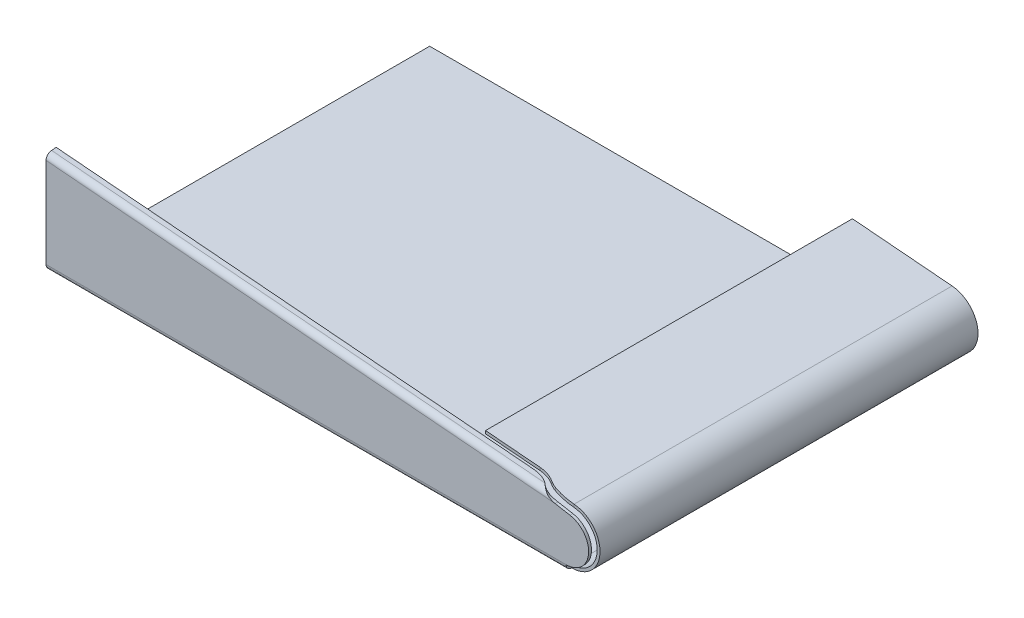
ISO-10303-21;
HEADER;
FILE_DESCRIPTION(('STEP AP214'),'2;1');
FILE_NAME('part.step','',(''),(''),'','','');
FILE_SCHEMA(('AUTOMOTIVE_DESIGN { 1 0 10303 214 1 1 1 1 }'));
ENDSEC;
DATA;
#1=APPLICATION_CONTEXT('core data for automotive mechanical design processes');
#2=APPLICATION_PROTOCOL_DEFINITION('international standard','automotive_design',2000,#1);
#3=PRODUCT_CONTEXT('',#1,'mechanical');
#4=PRODUCT('Part','Part','',(#3));
#5=PRODUCT_RELATED_PRODUCT_CATEGORY('part','',(#4));
#6=PRODUCT_DEFINITION_FORMATION('','',#4);
#7=PRODUCT_DEFINITION_CONTEXT('part definition',#1,'design');
#8=PRODUCT_DEFINITION('design','',#6,#7);
#9=PRODUCT_DEFINITION_SHAPE('','',#8);
#10=(LENGTH_UNIT() NAMED_UNIT(*) SI_UNIT(.MILLI.,.METRE.));
#11=(NAMED_UNIT(*) PLANE_ANGLE_UNIT() SI_UNIT($,.RADIAN.));
#12=(NAMED_UNIT(*) SI_UNIT($,.STERADIAN.) SOLID_ANGLE_UNIT());
#13=UNCERTAINTY_MEASURE_WITH_UNIT(LENGTH_MEASURE(1.E-05),#10,'distance_accuracy_value','');
#14=(GEOMETRIC_REPRESENTATION_CONTEXT(3) GLOBAL_UNCERTAINTY_ASSIGNED_CONTEXT((#13)) GLOBAL_UNIT_ASSIGNED_CONTEXT((#10,
#11,#12)) REPRESENTATION_CONTEXT('',''));
#15=CARTESIAN_POINT('',(0.,0.,0.));
#16=DIRECTION('',(0.,0.,1.));
#17=DIRECTION('',(1.,0.,0.));
#18=AXIS2_PLACEMENT_3D('',#15,#16,#17);
#19=CARTESIAN_POINT('',(-40.2949347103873,19.7996144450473,-135.));
#20=DIRECTION('',(-0.996506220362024,0.0835185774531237,0.));
#21=DIRECTION('',(0.,0.,1.));
#22=AXIS2_PLACEMENT_3D('',#19,#20,#21);
#23=PLANE('',#22);
#24=DIRECTION('',(0.,0.,1.));
#25=VECTOR('',#24,1.);
#26=CARTESIAN_POINT('',(-40.2949347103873,19.7996144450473,-135.));
#27=LINE('',#26,#25);
#28=CARTESIAN_POINT('',(-40.2949347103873,19.7996144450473,-135.));
#29=VERTEX_POINT('',#28);
#30=CARTESIAN_POINT('',(-40.2949347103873,19.7996144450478,-5.91639907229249));
#31=VERTEX_POINT('',#30);
#32=EDGE_CURVE('E695',#29,#31,#27,.T.);
#33=ORIENTED_EDGE('',*,*,#32,.T.);
#34=DIRECTION('',(0.0835185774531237,0.996506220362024,0.));
#35=VECTOR('',#34,1.);
#36=CARTESIAN_POINT('',(-40.2114161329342,20.7961206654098,-5.91639907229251));
#37=LINE('',#36,#35);
#38=CARTESIAN_POINT('',(-40.2114161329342,20.7961206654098,-5.91639907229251));
#39=VERTEX_POINT('',#38);
#40=EDGE_CURVE('E727',#39,#31,#37,.F.);
#41=ORIENTED_EDGE('',*,*,#40,.F.);
#42=DIRECTION('',(0.,0.,1.));
#43=VECTOR('',#42,1.);
#44=CARTESIAN_POINT('',(-40.2114161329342,20.7961206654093,-135.));
#45=LINE('',#44,#43);
#46=CARTESIAN_POINT('',(-40.2114161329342,20.7961206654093,-135.));
#47=VERTEX_POINT('',#46);
#48=EDGE_CURVE('E709',#47,#39,#45,.T.);
#49=ORIENTED_EDGE('',*,*,#48,.F.);
#50=DIRECTION('',(0.0835185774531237,0.996506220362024,0.));
#51=VECTOR('',#50,1.);
#52=CARTESIAN_POINT('',(-40.2949347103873,19.7996144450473,-135.));
#53=LINE('',#52,#51);
#54=EDGE_CURVE('E688',#29,#47,#53,.T.);
#55=ORIENTED_EDGE('',*,*,#54,.F.);
#56=EDGE_LOOP('',(#33,#41,#49,#55));
#57=FACE_BOUND('',#56,.T.);
#58=ADVANCED_FACE('F99',(#57),#23,.T.);
#59=CARTESIAN_POINT('',(-5.13452790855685,17.8562776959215,-135.));
#60=DIRECTION('',(0.0835185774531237,0.996506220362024,0.));
#61=DIRECTION('',(-0.996506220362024,0.0835185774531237,0.));
#62=AXIS2_PLACEMENT_3D('',#59,#60,#61);
#63=PLANE('',#62);
#64=ORIENTED_EDGE('',*,*,#48,.T.);
#65=DIRECTION('',(-0.996506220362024,0.0835185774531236,0.));
#66=VECTOR('',#65,1.);
#67=CARTESIAN_POINT('',(-21.0104792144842,19.18686333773,-5.91639907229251));
#68=LINE('',#67,#66);
#69=CARTESIAN_POINT('',(-21.0104792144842,19.18686333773,-5.91639907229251));
#70=VERTEX_POINT('',#69);
#71=EDGE_CURVE('E729',#70,#39,#68,.T.);
#72=ORIENTED_EDGE('',*,*,#71,.F.);
#73=CARTESIAN_POINT('',(-21.0104792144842,19.18686333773,5.0836009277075));
#74=DIRECTION('',(0.0835185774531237,0.996506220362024,0.));
#75=DIRECTION('',(-0.996506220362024,0.0835185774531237,0.));
#76=AXIS2_PLACEMENT_3D('',#73,#74,#75);
#77=CIRCLE('',#76,11.);
#78=CARTESIAN_POINT('',(-15.1814977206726,18.6983282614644,-4.23220865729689));
#79=VERTEX_POINT('',#78);
#80=EDGE_CURVE('E732',#79,#70,#77,.T.);
#81=ORIENTED_EDGE('',*,*,#80,.F.);
#82=CARTESIAN_POINT('',(-9.88242363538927,18.2542054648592,-12.7011264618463));
#83=DIRECTION('',(-0.0835185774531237,-0.996506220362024,0.));
#84=DIRECTION('',(0.996506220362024,-0.0835185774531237,0.));
#85=AXIS2_PLACEMENT_3D('',#82,#83,#84);
#86=CIRCLE('',#85,10.);
#87=CARTESIAN_POINT('',(-12.7530793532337,18.4947991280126,-3.12503903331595));
#88=VERTEX_POINT('',#87);
#89=EDGE_CURVE('E734',#88,#79,#86,.T.);
#90=ORIENTED_EDGE('',*,*,#89,.F.);
#91=CARTESIAN_POINT('',(-5.13452790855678,17.8562776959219,-28.5394118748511));
#92=DIRECTION('',(-0.0835185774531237,-0.996506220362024,0.));
#93=DIRECTION('',(-0.996506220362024,0.0835185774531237,0.));
#94=AXIS2_PLACEMENT_3D('',#91,#92,#93);
#95=CIRCLE('',#94,26.539411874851);
#96=CARTESIAN_POINT('',(-5.13452790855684,17.856277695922,-2.00000000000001));
#97=VERTEX_POINT('',#96);
#98=EDGE_CURVE('E736',#97,#88,#95,.T.);
#99=ORIENTED_EDGE('',*,*,#98,.F.);
#100=DIRECTION('',(0.,0.,1.));
#101=VECTOR('',#100,1.);
#102=CARTESIAN_POINT('',(-5.13452790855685,17.8562776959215,-135.));
#103=LINE('',#102,#101);
#104=CARTESIAN_POINT('',(-5.13452790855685,17.8562776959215,-135.));
#105=VERTEX_POINT('',#104);
#106=EDGE_CURVE('E712',#105,#97,#103,.T.);
#107=ORIENTED_EDGE('',*,*,#106,.F.);
#108=DIRECTION('',(-0.996506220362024,0.0835185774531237,0.));
#109=VECTOR('',#108,1.);
#110=CARTESIAN_POINT('',(-5.13452790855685,17.8562776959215,-135.));
#111=LINE('',#110,#109);
#112=EDGE_CURVE('E713',#105,#47,#111,.T.);
#113=ORIENTED_EDGE('',*,*,#112,.T.);
#114=EDGE_LOOP('',(#64,#72,#81,#90,#99,#107,#113));
#115=FACE_BOUND('',#114,.T.);
#116=ADVANCED_FACE('F548',(#115),#63,.T.);
#117=CARTESIAN_POINT('',(-5.21804648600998,16.8597714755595,-135.));
#118=DIRECTION('',(0.0835185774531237,0.996506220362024,0.));
#119=DIRECTION('',(-0.996506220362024,0.0835185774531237,0.));
#120=AXIS2_PLACEMENT_3D('',#117,#118,#119);
#121=PLANE('',#120);
#122=DIRECTION('',(-0.996506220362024,0.0835185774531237,0.));
#123=VECTOR('',#122,1.);
#124=CARTESIAN_POINT('',(-5.21804648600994,16.8597714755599,-5.91639907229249));
#125=LINE('',#124,#123);
#126=CARTESIAN_POINT('',(-21.0939977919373,18.190357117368,-5.91639907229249));
#127=VERTEX_POINT('',#126);
#128=EDGE_CURVE('E454',#127,#31,#125,.T.);
#129=ORIENTED_EDGE('',*,*,#128,.T.);
#130=ORIENTED_EDGE('',*,*,#32,.F.);
#131=DIRECTION('',(-0.996506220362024,0.0835185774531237,0.));
#132=VECTOR('',#131,1.);
#133=CARTESIAN_POINT('',(-5.21804648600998,16.8597714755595,-135.));
#134=LINE('',#133,#132);
#135=CARTESIAN_POINT('',(-5.21804648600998,16.8597714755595,-135.));
#136=VERTEX_POINT('',#135);
#137=EDGE_CURVE('E699',#136,#29,#134,.T.);
#138=ORIENTED_EDGE('',*,*,#137,.F.);
#139=DIRECTION('',(0.,0.,1.));
#140=VECTOR('',#139,1.);
#141=CARTESIAN_POINT('',(-5.21804648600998,16.8597714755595,-135.));
#142=LINE('',#141,#140);
#143=CARTESIAN_POINT('',(-5.21804648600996,16.8597714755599,-2.));
#144=VERTEX_POINT('',#143);
#145=EDGE_CURVE('E696',#136,#144,#142,.T.);
#146=ORIENTED_EDGE('',*,*,#145,.T.);
#147=CARTESIAN_POINT('',(-5.2180464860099,16.8597714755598,-28.539411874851));
#148=DIRECTION('',(-0.0835185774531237,-0.996506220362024,0.));
#149=DIRECTION('',(0.996506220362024,-0.0835185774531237,0.));
#150=AXIS2_PLACEMENT_3D('',#147,#148,#149);
#151=CIRCLE('',#150,26.539411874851);
#152=CARTESIAN_POINT('',(-12.8365979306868,17.4982929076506,-3.12503903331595));
#153=VERTEX_POINT('',#152);
#154=EDGE_CURVE('E731',#144,#153,#151,.T.);
#155=ORIENTED_EDGE('',*,*,#154,.T.);
#156=CARTESIAN_POINT('',(-9.9659422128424,17.2576992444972,-12.7011264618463));
#157=DIRECTION('',(-0.0835185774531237,-0.996506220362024,0.));
#158=DIRECTION('',(0.996506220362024,-0.0835185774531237,0.));
#159=AXIS2_PLACEMENT_3D('',#156,#157,#158);
#160=CIRCLE('',#159,10.);
#161=CARTESIAN_POINT('',(-15.2650162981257,17.7018220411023,-4.2322086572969));
#162=VERTEX_POINT('',#161);
#163=EDGE_CURVE('E740',#153,#162,#160,.T.);
#164=ORIENTED_EDGE('',*,*,#163,.T.);
#165=CARTESIAN_POINT('',(-21.0939977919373,18.190357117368,5.0836009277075));
#166=DIRECTION('',(0.0835185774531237,0.996506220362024,0.));
#167=DIRECTION('',(-0.996506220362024,0.0835185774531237,0.));
#168=AXIS2_PLACEMENT_3D('',#165,#166,#167);
#169=CIRCLE('',#168,11.);
#170=EDGE_CURVE('E742',#162,#127,#169,.T.);
#171=ORIENTED_EDGE('',*,*,#170,.T.);
#172=EDGE_LOOP('',(#129,#130,#138,#146,#155,#164,#171));
#173=FACE_BOUND('',#172,.T.);
#174=ADVANCED_FACE('F554',(#173),#121,.F.);
#175=CARTESIAN_POINT('',(-5.96516296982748,7.9455125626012,-1.));
#176=DIRECTION('',(0.,0.,1.));
#177=DIRECTION('',(1.,0.,0.));
#178=AXIS2_PLACEMENT_3D('',#175,#176,#177);
#179=CYLINDRICAL_SURFACE('',#178,7.9455125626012);
#180=CARTESIAN_POINT('',(-5.96516296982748,7.9455125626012,0.));
#181=DIRECTION('',(0.,0.,1.));
#182=DIRECTION('',(-1.,0.,0.));
#183=AXIS2_PLACEMENT_3D('',#180,#181,#182);
#184=CIRCLE('',#183,7.9455125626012);
#185=CARTESIAN_POINT('',(-5.96516296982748,0.,0.));
#186=VERTEX_POINT('',#185);
#187=CARTESIAN_POINT('',(-4.57904868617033,15.769185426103,0.));
#188=VERTEX_POINT('',#187);
#189=EDGE_CURVE('E524',#186,#188,#184,.T.);
#190=ORIENTED_EDGE('',*,*,#189,.F.);
#191=DIRECTION('',(0.,0.,1.));
#192=VECTOR('',#191,1.);
#193=CARTESIAN_POINT('',(-5.96516296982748,0.,-1.));
#194=LINE('',#193,#192);
#195=CARTESIAN_POINT('',(-5.96516296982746,0.,-1.));
#196=VERTEX_POINT('',#195);
#197=EDGE_CURVE('E618',#196,#186,#194,.T.);
#198=ORIENTED_EDGE('',*,*,#197,.F.);
#199=CARTESIAN_POINT('',(-5.96516296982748,7.9455125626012,-1.));
#200=DIRECTION('',(0.,0.,1.));
#201=DIRECTION('',(-1.,0.,0.));
#202=AXIS2_PLACEMENT_3D('',#199,#200,#201);
#203=CIRCLE('',#202,7.9455125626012);
#204=CARTESIAN_POINT('',(-4.57904868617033,15.769185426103,-1.));
#205=VERTEX_POINT('',#204);
#206=EDGE_CURVE('E626',#196,#205,#203,.T.);
#207=ORIENTED_EDGE('',*,*,#206,.T.);
#208=DIRECTION('',(0.,0.,1.));
#209=VECTOR('',#208,1.);
#210=CARTESIAN_POINT('',(-4.57904868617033,15.769185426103,-1.));
#211=LINE('',#210,#209);
#212=EDGE_CURVE('E527',#205,#188,#211,.T.);
#213=ORIENTED_EDGE('',*,*,#212,.T.);
#214=EDGE_LOOP('',(#190,#198,#207,#213));
#215=FACE_BOUND('',#214,.T.);
#216=ADVANCED_FACE('F604',(#215),#179,.T.);
#217=CARTESIAN_POINT('',(-5.96516296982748,7.9455125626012,-1.));
#218=DIRECTION('',(0.,0.,-1.));
#219=DIRECTION('',(-1.,0.,0.));
#220=AXIS2_PLACEMENT_3D('',#217,#218,#219);
#221=PLANE('',#220);
#222=DIRECTION('',(-0.996506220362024,0.0835185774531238,0.));
#223=VECTOR('',#222,1.);
#224=CARTESIAN_POINT('',(-5.26346530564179,16.3178544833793,-1.));
#225=LINE('',#224,#223);
#226=CARTESIAN_POINT('',(-9.8416709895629,16.7015602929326,-1.));
#227=VERTEX_POINT('',#226);
#228=CARTESIAN_POINT('',(-188.956808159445,31.7134499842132,-1.));
#229=VERTEX_POINT('',#228);
#230=EDGE_CURVE('E354',#227,#229,#225,.T.);
#231=ORIENTED_EDGE('',*,*,#230,.F.);
#232=DIRECTION('',(-0.984665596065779,0.174452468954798,0.));
#233=VECTOR('',#232,1.);
#234=CARTESIAN_POINT('',(-4.57904868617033,15.769185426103,-1.));
#235=LINE('',#234,#233);
#236=EDGE_CURVE('E497',#205,#227,#235,.T.);
#237=ORIENTED_EDGE('',*,*,#236,.F.);
#238=ORIENTED_EDGE('',*,*,#206,.F.);
#239=DIRECTION('',(1.,0.,0.));
#240=VECTOR('',#239,1.);
#241=CARTESIAN_POINT('',(-188.956808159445,0.,-1.));
#242=LINE('',#241,#240);
#243=CARTESIAN_POINT('',(-188.956808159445,0.,-1.));
#244=VERTEX_POINT('',#243);
#245=EDGE_CURVE('E629',#244,#196,#242,.T.);
#246=ORIENTED_EDGE('',*,*,#245,.F.);
#247=DIRECTION('',(0.,-1.,0.));
#248=VECTOR('',#247,1.);
#249=CARTESIAN_POINT('',(-188.956808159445,35.8223017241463,-1.));
#250=LINE('',#249,#248);
#251=EDGE_CURVE('E522',#229,#244,#250,.T.);
#252=ORIENTED_EDGE('',*,*,#251,.F.);
#253=EDGE_LOOP('',(#231,#237,#238,#246,#252));
#254=FACE_BOUND('',#253,.T.);
#255=ADVANCED_FACE('F540',(#254),#221,.T.);
#256=CARTESIAN_POINT('',(-4.57904868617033,15.769185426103,-1.));
#257=DIRECTION('',(0.174452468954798,0.984665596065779,0.));
#258=DIRECTION('',(-0.984665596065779,0.174452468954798,0.));
#259=AXIS2_PLACEMENT_3D('',#256,#257,#258);
#260=PLANE('',#259);
#261=DIRECTION('',(-0.984665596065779,0.174452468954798,0.));
#262=VECTOR('',#261,1.);
#263=CARTESIAN_POINT('',(-4.57904868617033,15.769185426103,0.));
#264=LINE('',#263,#262);
#265=CARTESIAN_POINT('',(-9.84167098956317,16.7015602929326,0.));
#266=VERTEX_POINT('',#265);
#267=EDGE_CURVE('E116',#188,#266,#264,.T.);
#268=ORIENTED_EDGE('',*,*,#267,.F.);
#269=ORIENTED_EDGE('',*,*,#212,.F.);
#270=ORIENTED_EDGE('',*,*,#236,.T.);
#271=CARTESIAN_POINT('',(-9.8416709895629,16.7015602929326,0.));
#272=CARTESIAN_POINT('',(-9.8416709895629,16.7015602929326,-1.));
#273=B_SPLINE_CURVE_WITH_KNOTS('',1,(#271,#272),.UNSPECIFIED.,.F.,.F.,(2,2),(0.,1.),.UNSPECIFIED.);
#274=EDGE_CURVE('E13',#266,#227,#273,.T.);
#275=ORIENTED_EDGE('',*,*,#274,.F.);
#276=EDGE_LOOP('',(#268,#269,#270,#275));
#277=FACE_BOUND('',#276,.T.);
#278=ADVANCED_FACE('F495',(#277),#260,.T.);
#279=CARTESIAN_POINT('',(-5.96516296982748,7.9455125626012,0.));
#280=DIRECTION('',(0.,0.,-1.));
#281=DIRECTION('',(-1.,0.,0.));
#282=AXIS2_PLACEMENT_3D('',#279,#280,#281);
#283=PLANE('',#282);
#284=ORIENTED_EDGE('',*,*,#267,.T.);
#285=DIRECTION('',(-0.996506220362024,0.0835185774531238,0.));
#286=VECTOR('',#285,1.);
#287=CARTESIAN_POINT('',(-5.26346530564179,16.3178544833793,0.));
#288=LINE('',#287,#286);
#289=CARTESIAN_POINT('',(-188.956808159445,31.7134499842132,0.));
#290=VERTEX_POINT('',#289);
#291=EDGE_CURVE('E109',#266,#290,#288,.T.);
#292=ORIENTED_EDGE('',*,*,#291,.T.);
#293=DIRECTION('',(0.,-1.,0.));
#294=VECTOR('',#293,1.);
#295=CARTESIAN_POINT('',(-188.956808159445,35.8223017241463,0.));
#296=LINE('',#295,#294);
#297=CARTESIAN_POINT('',(-188.956808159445,0.,0.));
#298=VERTEX_POINT('',#297);
#299=EDGE_CURVE('E124',#290,#298,#296,.T.);
#300=ORIENTED_EDGE('',*,*,#299,.T.);
#301=DIRECTION('',(1.,0.,0.));
#302=VECTOR('',#301,1.);
#303=CARTESIAN_POINT('',(-188.956808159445,0.,0.));
#304=LINE('',#303,#302);
#305=EDGE_CURVE('E509',#298,#186,#304,.T.);
#306=ORIENTED_EDGE('',*,*,#305,.T.);
#307=ORIENTED_EDGE('',*,*,#189,.T.);
#308=EDGE_LOOP('',(#284,#292,#300,#306,#307));
#309=FACE_BOUND('',#308,.T.);
#310=ADVANCED_FACE('F539',(#309),#283,.F.);
#311=CARTESIAN_POINT('',(-188.956808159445,35.8223017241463,-1.));
#312=DIRECTION('',(-1.,0.,0.));
#313=DIRECTION('',(0.,0.,1.));
#314=AXIS2_PLACEMENT_3D('',#311,#312,#313);
#315=PLANE('',#314);
#316=CARTESIAN_POINT('',(-188.956808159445,31.7134499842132,-1.));
#317=CARTESIAN_POINT('',(-188.956808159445,31.7134499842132,0.));
#318=B_SPLINE_CURVE_WITH_KNOTS('',1,(#316,#317),.UNSPECIFIED.,.F.,.F.,(2,2),(0.,1.),.UNSPECIFIED.);
#319=EDGE_CURVE('E500',#290,#229,#318,.F.);
#320=ORIENTED_EDGE('',*,*,#319,.T.);
#321=ORIENTED_EDGE('',*,*,#251,.T.);
#322=DIRECTION('',(0.,0.,1.));
#323=VECTOR('',#322,1.);
#324=CARTESIAN_POINT('',(-188.956808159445,0.,-1.));
#325=LINE('',#324,#323);
#326=EDGE_CURVE('E505',#244,#298,#325,.T.);
#327=ORIENTED_EDGE('',*,*,#326,.T.);
#328=ORIENTED_EDGE('',*,*,#299,.F.);
#329=EDGE_LOOP('',(#320,#321,#327,#328));
#330=FACE_BOUND('',#329,.T.);
#331=ADVANCED_FACE('F101',(#330),#315,.T.);
#332=CARTESIAN_POINT('',(-5.96516296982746,0.,-2.));
#333=DIRECTION('',(1.,0.,0.));
#334=DIRECTION('',(0.,0.,-1.));
#335=AXIS2_PLACEMENT_3D('',#332,#333,#334);
#336=PLANE('',#335);
#337=DIRECTION('',(0.,-1.,0.));
#338=VECTOR('',#337,1.);
#339=CARTESIAN_POINT('',(-5.96516296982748,-2.00000000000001,-2.));
#340=LINE('',#339,#338);
#341=CARTESIAN_POINT('',(-5.96516296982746,-1.,-2.));
#342=VERTEX_POINT('',#341);
#343=CARTESIAN_POINT('',(-5.96516296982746,-2.,-1.99999999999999));
#344=VERTEX_POINT('',#343);
#345=EDGE_CURVE('E644',#342,#344,#340,.T.);
#346=ORIENTED_EDGE('',*,*,#345,.F.);
#347=CARTESIAN_POINT('',(-5.96516296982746,0.,-2.));
#348=DIRECTION('',(-1.,0.,0.));
#349=DIRECTION('',(0.,0.,1.));
#350=AXIS2_PLACEMENT_3D('',#347,#348,#349);
#351=CIRCLE('',#350,1.);
#352=EDGE_CURVE('E641',#196,#342,#351,.F.);
#353=ORIENTED_EDGE('',*,*,#352,.F.);
#354=ORIENTED_EDGE('',*,*,#197,.T.);
#355=CARTESIAN_POINT('',(-5.96516296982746,0.,-2.));
#356=DIRECTION('',(-1.,0.,0.));
#357=DIRECTION('',(0.,0.,1.));
#358=AXIS2_PLACEMENT_3D('',#355,#356,#357);
#359=CIRCLE('',#358,2.);
#360=EDGE_CURVE('E631',#186,#344,#359,.F.);
#361=ORIENTED_EDGE('',*,*,#360,.T.);
#362=EDGE_LOOP('',(#346,#353,#354,#361));
#363=FACE_BOUND('',#362,.T.);
#364=ADVANCED_FACE('F546',(#363),#336,.T.);
#365=CARTESIAN_POINT('',(-188.956808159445,0.,-2.));
#366=DIRECTION('',(1.,0.,0.));
#367=DIRECTION('',(0.,0.,-1.));
#368=AXIS2_PLACEMENT_3D('',#365,#366,#367);
#369=PLANE('',#368);
#370=CARTESIAN_POINT('',(-188.956808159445,0.,-2.));
#371=DIRECTION('',(-1.,0.,0.));
#372=DIRECTION('',(0.,0.,1.));
#373=AXIS2_PLACEMENT_3D('',#370,#371,#372);
#374=CIRCLE('',#373,1.);
#375=CARTESIAN_POINT('',(-188.956808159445,-1.,-2.));
#376=VERTEX_POINT('',#375);
#377=EDGE_CURVE('E648',#376,#244,#374,.T.);
#378=ORIENTED_EDGE('',*,*,#377,.F.);
#379=DIRECTION('',(0.,-1.,0.));
#380=VECTOR('',#379,1.);
#381=CARTESIAN_POINT('',(-188.956808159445,-1.,-2.));
#382=LINE('',#381,#380);
#383=CARTESIAN_POINT('',(-188.956808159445,-2.,-1.99999999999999));
#384=VERTEX_POINT('',#383);
#385=EDGE_CURVE('E657',#376,#384,#382,.T.);
#386=ORIENTED_EDGE('',*,*,#385,.T.);
#387=CARTESIAN_POINT('',(-188.956808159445,0.,-2.));
#388=DIRECTION('',(-1.,0.,0.));
#389=DIRECTION('',(0.,0.,1.));
#390=AXIS2_PLACEMENT_3D('',#387,#388,#389);
#391=CIRCLE('',#390,2.);
#392=EDGE_CURVE('E638',#384,#298,#391,.T.);
#393=ORIENTED_EDGE('',*,*,#392,.T.);
#394=ORIENTED_EDGE('',*,*,#326,.F.);
#395=EDGE_LOOP('',(#378,#386,#393,#394));
#396=FACE_BOUND('',#395,.T.);
#397=ADVANCED_FACE('F594',(#396),#369,.F.);
#398=CARTESIAN_POINT('',(-188.956808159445,0.,-2.));
#399=DIRECTION('',(-1.,0.,0.));
#400=DIRECTION('',(0.,-1.,0.));
#401=AXIS2_PLACEMENT_3D('',#398,#399,#400);
#402=CYLINDRICAL_SURFACE('',#401,2.);
#403=ORIENTED_EDGE('',*,*,#305,.F.);
#404=ORIENTED_EDGE('',*,*,#392,.F.);
#405=DIRECTION('',(-1.,0.,0.));
#406=VECTOR('',#405,1.);
#407=CARTESIAN_POINT('',(0.,-2.,-1.99999999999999));
#408=LINE('',#407,#406);
#409=EDGE_CURVE('E658',#344,#384,#408,.T.);
#410=ORIENTED_EDGE('',*,*,#409,.F.);
#411=ORIENTED_EDGE('',*,*,#360,.F.);
#412=EDGE_LOOP('',(#403,#404,#410,#411));
#413=FACE_BOUND('',#412,.T.);
#414=ADVANCED_FACE('F591',(#413),#402,.T.);
#415=CARTESIAN_POINT('',(-188.956808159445,0.,-2.));
#416=DIRECTION('',(-1.,0.,0.));
#417=DIRECTION('',(0.,-1.,0.));
#418=AXIS2_PLACEMENT_3D('',#415,#416,#417);
#419=CYLINDRICAL_SURFACE('',#418,1.);
#420=ORIENTED_EDGE('',*,*,#245,.T.);
#421=ORIENTED_EDGE('',*,*,#352,.T.);
#422=DIRECTION('',(1.,0.,0.));
#423=VECTOR('',#422,1.);
#424=CARTESIAN_POINT('',(-5.96516296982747,-1.,-2.));
#425=LINE('',#424,#423);
#426=EDGE_CURVE('E654',#342,#376,#425,.F.);
#427=ORIENTED_EDGE('',*,*,#426,.T.);
#428=ORIENTED_EDGE('',*,*,#377,.T.);
#429=EDGE_LOOP('',(#420,#421,#427,#428));
#430=FACE_BOUND('',#429,.T.);
#431=ADVANCED_FACE('F586',(#430),#419,.F.);
#432=CARTESIAN_POINT('',(-188.956808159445,-2.,-0.999999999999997));
#433=DIRECTION('',(-1.,0.,0.));
#434=DIRECTION('',(0.,0.,1.));
#435=AXIS2_PLACEMENT_3D('',#432,#433,#434);
#436=PLANE('',#435);
#437=DIRECTION('',(0.,0.,1.));
#438=VECTOR('',#437,1.);
#439=CARTESIAN_POINT('',(-188.956808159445,-2.,-0.999999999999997));
#440=LINE('',#439,#438);
#441=CARTESIAN_POINT('',(-188.956808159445,-2.00000000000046,-135.));
#442=VERTEX_POINT('',#441);
#443=EDGE_CURVE('E678',#442,#384,#440,.T.);
#444=ORIENTED_EDGE('',*,*,#443,.T.);
#445=ORIENTED_EDGE('',*,*,#385,.F.);
#446=DIRECTION('',(0.,0.,-1.));
#447=VECTOR('',#446,1.);
#448=CARTESIAN_POINT('',(-188.956808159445,-0.999999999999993,0.));
#449=LINE('',#448,#447);
#450=CARTESIAN_POINT('',(-188.956808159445,-1.00000000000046,-135.));
#451=VERTEX_POINT('',#450);
#452=EDGE_CURVE('E670',#451,#376,#449,.F.);
#453=ORIENTED_EDGE('',*,*,#452,.F.);
#454=DIRECTION('',(0.,1.,0.));
#455=VECTOR('',#454,1.);
#456=CARTESIAN_POINT('',(-188.956808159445,-2.00000000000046,-135.));
#457=LINE('',#456,#455);
#458=EDGE_CURVE('E649',#442,#451,#457,.T.);
#459=ORIENTED_EDGE('',*,*,#458,.F.);
#460=EDGE_LOOP('',(#444,#445,#453,#459));
#461=FACE_BOUND('',#460,.T.);
#462=ADVANCED_FACE('F579',(#461),#436,.T.);
#463=CARTESIAN_POINT('',(0.,-1.99999999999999,0.));
#464=DIRECTION('',(0.,-1.,0.));
#465=DIRECTION('',(0.,0.,-1.));
#466=AXIS2_PLACEMENT_3D('',#463,#464,#465);
#467=PLANE('',#466);
#468=DIRECTION('',(0.,0.,-1.));
#469=VECTOR('',#468,1.);
#470=CARTESIAN_POINT('',(-5.96516296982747,-2.00000000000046,-135.));
#471=LINE('',#470,#469);
#472=CARTESIAN_POINT('',(-5.96516296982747,-2.00000000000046,-135.));
#473=VERTEX_POINT('',#472);
#474=EDGE_CURVE('E672',#344,#473,#471,.T.);
#475=ORIENTED_EDGE('',*,*,#474,.F.);
#476=ORIENTED_EDGE('',*,*,#409,.T.);
#477=ORIENTED_EDGE('',*,*,#443,.F.);
#478=DIRECTION('',(-1.,0.,0.));
#479=VECTOR('',#478,1.);
#480=CARTESIAN_POINT('',(-188.956808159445,-2.00000000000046,-135.));
#481=LINE('',#480,#479);
#482=EDGE_CURVE('E675',#473,#442,#481,.T.);
#483=ORIENTED_EDGE('',*,*,#482,.F.);
#484=EDGE_LOOP('',(#475,#476,#477,#483));
#485=FACE_BOUND('',#484,.T.);
#486=ADVANCED_FACE('F575',(#485),#467,.T.);
#487=CARTESIAN_POINT('',(0.,-0.999999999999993,0.));
#488=DIRECTION('',(0.,-1.,0.));
#489=DIRECTION('',(0.,0.,-1.));
#490=AXIS2_PLACEMENT_3D('',#487,#488,#489);
#491=PLANE('',#490);
#492=ORIENTED_EDGE('',*,*,#426,.F.);
#493=DIRECTION('',(0.,0.,1.));
#494=VECTOR('',#493,1.);
#495=CARTESIAN_POINT('',(-5.96516296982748,-0.999999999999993,0.));
#496=LINE('',#495,#494);
#497=CARTESIAN_POINT('',(-5.96516296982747,-1.00000000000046,-135.));
#498=VERTEX_POINT('',#497);
#499=EDGE_CURVE('E665',#342,#498,#496,.F.);
#500=ORIENTED_EDGE('',*,*,#499,.T.);
#501=DIRECTION('',(1.,0.,0.));
#502=VECTOR('',#501,1.);
#503=CARTESIAN_POINT('',(0.,-1.00000000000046,-135.));
#504=LINE('',#503,#502);
#505=EDGE_CURVE('E667',#498,#451,#504,.F.);
#506=ORIENTED_EDGE('',*,*,#505,.T.);
#507=ORIENTED_EDGE('',*,*,#452,.T.);
#508=EDGE_LOOP('',(#492,#500,#506,#507));
#509=FACE_BOUND('',#508,.T.);
#510=ADVANCED_FACE('F578',(#509),#491,.F.);
#511=CARTESIAN_POINT('',(-188.956808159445,-2.00000000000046,-135.));
#512=DIRECTION('',(0.,0.,-1.));
#513=DIRECTION('',(0.,1.,0.));
#514=AXIS2_PLACEMENT_3D('',#511,#512,#513);
#515=PLANE('',#514);
#516=ORIENTED_EDGE('',*,*,#505,.F.);
#517=DIRECTION('',(0.,1.,0.));
#518=VECTOR('',#517,1.);
#519=CARTESIAN_POINT('',(-5.96516296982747,-2.00000000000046,-135.));
#520=LINE('',#519,#518);
#521=EDGE_CURVE('E681',#473,#498,#520,.T.);
#522=ORIENTED_EDGE('',*,*,#521,.F.);
#523=ORIENTED_EDGE('',*,*,#482,.T.);
#524=ORIENTED_EDGE('',*,*,#458,.T.);
#525=EDGE_LOOP('',(#516,#522,#523,#524));
#526=FACE_BOUND('',#525,.T.);
#527=ADVANCED_FACE('F573',(#526),#515,.T.);
#528=CARTESIAN_POINT('',(-5.96516296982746,7.9455125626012,-2.));
#529=DIRECTION('',(0.,0.,-1.));
#530=DIRECTION('',(-1.,0.,0.));
#531=AXIS2_PLACEMENT_3D('',#528,#529,#530);
#532=PLANE('',#531);
#533=DIRECTION('',(0.0835185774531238,0.996506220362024,0.));
#534=VECTOR('',#533,1.);
#535=CARTESIAN_POINT('',(-5.21804648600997,16.8597714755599,-2.));
#536=LINE('',#535,#534);
#537=EDGE_CURVE('E661',#144,#97,#536,.T.);
#538=ORIENTED_EDGE('',*,*,#537,.F.);
#539=CARTESIAN_POINT('',(-5.96516296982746,7.9455125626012,-2.));
#540=DIRECTION('',(0.,0.,1.));
#541=DIRECTION('',(1.,0.,0.));
#542=AXIS2_PLACEMENT_3D('',#539,#540,#541);
#543=CIRCLE('',#542,8.9455125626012);
#544=EDGE_CURVE('E691',#144,#342,#543,.F.);
#545=ORIENTED_EDGE('',*,*,#544,.T.);
#546=ORIENTED_EDGE('',*,*,#345,.T.);
#547=CARTESIAN_POINT('',(-5.96516296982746,7.9455125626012,-1.99999999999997));
#548=DIRECTION('',(0.,0.,1.));
#549=DIRECTION('',(0.,-1.,0.));
#550=AXIS2_PLACEMENT_3D('',#547,#548,#549);
#551=CIRCLE('',#550,9.9455125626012);
#552=EDGE_CURVE('E690',#97,#344,#551,.F.);
#553=ORIENTED_EDGE('',*,*,#552,.F.);
#554=EDGE_LOOP('',(#538,#545,#546,#553));
#555=FACE_BOUND('',#554,.T.);
#556=ADVANCED_FACE('F569',(#555),#532,.F.);
#557=CARTESIAN_POINT('',(-5.96516296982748,7.94551256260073,-135.));
#558=DIRECTION('',(0.,0.,-1.));
#559=DIRECTION('',(0.,1.,0.));
#560=AXIS2_PLACEMENT_3D('',#557,#558,#559);
#561=PLANE('',#560);
#562=ORIENTED_EDGE('',*,*,#521,.T.);
#563=CARTESIAN_POINT('',(-5.96516296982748,7.94551256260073,-135.));
#564=DIRECTION('',(0.,0.,1.));
#565=DIRECTION('',(0.,1.,0.));
#566=AXIS2_PLACEMENT_3D('',#563,#564,#565);
#567=CIRCLE('',#566,8.9455125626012);
#568=EDGE_CURVE('E700',#498,#136,#567,.T.);
#569=ORIENTED_EDGE('',*,*,#568,.T.);
#570=DIRECTION('',(0.0835185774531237,0.996506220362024,0.));
#571=VECTOR('',#570,1.);
#572=CARTESIAN_POINT('',(-5.21804648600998,16.8597714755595,-135.));
#573=LINE('',#572,#571);
#574=EDGE_CURVE('E686',#136,#105,#573,.T.);
#575=ORIENTED_EDGE('',*,*,#574,.T.);
#576=CARTESIAN_POINT('',(-5.96516296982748,7.94551256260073,-135.));
#577=DIRECTION('',(0.,0.,1.));
#578=DIRECTION('',(0.,-1.,0.));
#579=AXIS2_PLACEMENT_3D('',#576,#577,#578);
#580=CIRCLE('',#579,9.9455125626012);
#581=EDGE_CURVE('E694',#473,#105,#580,.T.);
#582=ORIENTED_EDGE('',*,*,#581,.F.);
#583=EDGE_LOOP('',(#562,#569,#575,#582));
#584=FACE_BOUND('',#583,.T.);
#585=ADVANCED_FACE('F565',(#584),#561,.T.);
#586=CARTESIAN_POINT('',(-5.21804648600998,16.8597714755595,-135.));
#587=DIRECTION('',(0.,0.,-1.));
#588=DIRECTION('',(-0.996506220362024,0.0835185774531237,0.));
#589=AXIS2_PLACEMENT_3D('',#586,#587,#588);
#590=PLANE('',#589);
#591=ORIENTED_EDGE('',*,*,#574,.F.);
#592=ORIENTED_EDGE('',*,*,#137,.T.);
#593=ORIENTED_EDGE('',*,*,#54,.T.);
#594=ORIENTED_EDGE('',*,*,#112,.F.);
#595=EDGE_LOOP('',(#591,#592,#593,#594));
#596=FACE_BOUND('',#595,.T.);
#597=ADVANCED_FACE('F561',(#596),#590,.T.);
#598=CARTESIAN_POINT('',(-5.96516296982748,7.94551256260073,-135.));
#599=DIRECTION('',(0.,0.,1.));
#600=DIRECTION('',(0.,-1.,0.));
#601=AXIS2_PLACEMENT_3D('',#598,#599,#600);
#602=CYLINDRICAL_SURFACE('',#601,9.9455125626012);
#603=ORIENTED_EDGE('',*,*,#106,.T.);
#604=ORIENTED_EDGE('',*,*,#552,.T.);
#605=ORIENTED_EDGE('',*,*,#474,.T.);
#606=ORIENTED_EDGE('',*,*,#581,.T.);
#607=EDGE_LOOP('',(#603,#604,#605,#606));
#608=FACE_BOUND('',#607,.T.);
#609=ADVANCED_FACE('F564',(#608),#602,.T.);
#610=CARTESIAN_POINT('',(-5.96516296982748,7.94551256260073,-135.));
#611=DIRECTION('',(0.,0.,1.));
#612=DIRECTION('',(0.,-1.,0.));
#613=AXIS2_PLACEMENT_3D('',#610,#611,#612);
#614=CYLINDRICAL_SURFACE('',#613,8.9455125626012);
#615=ORIENTED_EDGE('',*,*,#145,.F.);
#616=ORIENTED_EDGE('',*,*,#568,.F.);
#617=ORIENTED_EDGE('',*,*,#499,.F.);
#618=ORIENTED_EDGE('',*,*,#544,.F.);
#619=EDGE_LOOP('',(#615,#616,#617,#618));
#620=FACE_BOUND('',#619,.T.);
#621=ADVANCED_FACE('F763',(#620),#614,.F.);
#622=CARTESIAN_POINT('',(-9.88242363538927,18.2542054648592,-12.7011264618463));
#623=DIRECTION('',(-0.0835185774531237,-0.996506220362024,0.));
#624=DIRECTION('',(0.996506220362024,-0.0835185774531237,0.));
#625=AXIS2_PLACEMENT_3D('',#622,#623,#624);
#626=CYLINDRICAL_SURFACE('',#625,10.);
#627=DIRECTION('',(0.0835185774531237,0.996506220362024,0.));
#628=VECTOR('',#627,1.);
#629=CARTESIAN_POINT('',(-12.7530793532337,18.4947991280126,-3.12503903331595));
#630=LINE('',#629,#628);
#631=EDGE_CURVE('E704',#88,#153,#630,.F.);
#632=ORIENTED_EDGE('',*,*,#631,.F.);
#633=ORIENTED_EDGE('',*,*,#89,.T.);
#634=DIRECTION('',(0.0835185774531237,0.996506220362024,0.));
#635=VECTOR('',#634,1.);
#636=CARTESIAN_POINT('',(-15.1814977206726,18.6983282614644,-4.23220865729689));
#637=LINE('',#636,#635);
#638=EDGE_CURVE('E721',#79,#162,#637,.F.);
#639=ORIENTED_EDGE('',*,*,#638,.T.);
#640=ORIENTED_EDGE('',*,*,#163,.F.);
#641=EDGE_LOOP('',(#632,#633,#639,#640));
#642=FACE_BOUND('',#641,.T.);
#643=ADVANCED_FACE('F769',(#642),#626,.T.);
#644=CARTESIAN_POINT('',(-21.0104792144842,19.18686333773,5.0836009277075));
#645=DIRECTION('',(0.0835185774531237,0.996506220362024,0.));
#646=DIRECTION('',(-0.996506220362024,0.0835185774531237,0.));
#647=AXIS2_PLACEMENT_3D('',#644,#645,#646);
#648=CYLINDRICAL_SURFACE('',#647,11.);
#649=ORIENTED_EDGE('',*,*,#638,.F.);
#650=ORIENTED_EDGE('',*,*,#80,.T.);
#651=DIRECTION('',(0.0835185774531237,0.996506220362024,0.));
#652=VECTOR('',#651,1.);
#653=CARTESIAN_POINT('',(-21.0104792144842,19.18686333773,-5.91639907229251));
#654=LINE('',#653,#652);
#655=EDGE_CURVE('E724',#70,#127,#654,.F.);
#656=ORIENTED_EDGE('',*,*,#655,.T.);
#657=ORIENTED_EDGE('',*,*,#170,.F.);
#658=EDGE_LOOP('',(#649,#650,#656,#657));
#659=FACE_BOUND('',#658,.T.);
#660=ADVANCED_FACE('F773',(#659),#648,.F.);
#661=CARTESIAN_POINT('',(-21.0104792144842,19.18686333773,-5.91639907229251));
#662=DIRECTION('',(0.,0.,-1.));
#663=DIRECTION('',(-0.996506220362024,0.0835185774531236,0.));
#664=AXIS2_PLACEMENT_3D('',#661,#662,#663);
#665=PLANE('',#664);
#666=ORIENTED_EDGE('',*,*,#655,.F.);
#667=ORIENTED_EDGE('',*,*,#71,.T.);
#668=ORIENTED_EDGE('',*,*,#40,.T.);
#669=ORIENTED_EDGE('',*,*,#128,.F.);
#670=EDGE_LOOP('',(#666,#667,#668,#669));
#671=FACE_BOUND('',#670,.T.);
#672=ADVANCED_FACE('F413',(#671),#665,.F.);
#673=CARTESIAN_POINT('',(-5.13452790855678,17.8562776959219,-28.5394118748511));
#674=DIRECTION('',(-0.0835185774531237,-0.996506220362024,0.));
#675=DIRECTION('',(0.996506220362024,-0.0835185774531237,0.));
#676=AXIS2_PLACEMENT_3D('',#673,#674,#675);
#677=CYLINDRICAL_SURFACE('',#676,26.539411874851);
#678=ORIENTED_EDGE('',*,*,#98,.T.);
#679=ORIENTED_EDGE('',*,*,#631,.T.);
#680=ORIENTED_EDGE('',*,*,#154,.F.);
#681=ORIENTED_EDGE('',*,*,#537,.T.);
#682=EDGE_LOOP('',(#678,#679,#680,#681));
#683=FACE_BOUND('',#682,.T.);
#684=ADVANCED_FACE('F409',(#683),#677,.T.);
#685=CARTESIAN_POINT('',(-15.3578522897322,19.1708912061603,-2.));
#686=CARTESIAN_POINT('',(-15.2191119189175,19.1592631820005,-1.86627500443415));
#687=CARTESIAN_POINT('',(-15.0815049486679,19.1342276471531,-1.73256283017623));
#688=CARTESIAN_POINT('',(-14.9449897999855,19.0960492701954,-1.60151893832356));
#689=CARTESIAN_POINT('',(-15.4413708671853,18.1743849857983,-2.));
#690=CARTESIAN_POINT('',(-15.3026324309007,18.1627571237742,-1.9331384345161));
#691=CARTESIAN_POINT('',(-15.164459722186,18.1444252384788,-1.86628050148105));
#692=CARTESIAN_POINT('',(-15.0268338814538,18.1195223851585,-1.80075946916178));
#693=B_SPLINE_SURFACE_WITH_KNOTS('',1,3,((#685,#686,#687,#688),(#689,#690,#691,#692)),
.UNSPECIFIED.,.F.,.F.,.F.,(2,2),(4,4),(0.,1.),(0.,1.),.UNSPECIFIED.);
#694=CARTESIAN_POINT('',(-15.4413708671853,18.1743849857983,-2.));
#695=CARTESIAN_POINT('',(-15.3578522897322,19.1708912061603,-2.));
#696=B_SPLINE_CURVE_WITH_KNOTS('',1,(#694,#695),.UNSPECIFIED.,.F.,.F.,(2,2),(0.,1.),.UNSPECIFIED.);
#697=CARTESIAN_POINT('',(-15.3578522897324,19.1708912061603,-1.99999999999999));
#698=VERTEX_POINT('',#697);
#699=CARTESIAN_POINT('',(-15.4413708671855,18.1743849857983,-2.));
#700=VERTEX_POINT('',#699);
#701=EDGE_CURVE('E271',#698,#700,#696,.F.);
#702=CARTESIAN_POINT('',(-15.3578522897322,19.1708912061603,-2.));
#703=CARTESIAN_POINT('',(-15.2191119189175,19.1592631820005,-1.86627500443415));
#704=CARTESIAN_POINT('',(-15.0815049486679,19.1342276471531,-1.73256283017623));
#705=CARTESIAN_POINT('',(-14.9449897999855,19.0960492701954,-1.60151893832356));
#706=B_SPLINE_CURVE_WITH_KNOTS('',3,(#702,#703,#704,#705),.UNSPECIFIED.,.F.,.F.,(4,4),(0.,1.),.UNSPECIFIED.);
#707=CARTESIAN_POINT('',(-14.9449942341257,19.0960505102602,-1.6015231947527));
#708=VERTEX_POINT('',#707);
#709=EDGE_CURVE('E274',#698,#708,#706,.T.);
#710=CARTESIAN_POINT('',(-14.9449897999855,19.0960492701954,-1.60151893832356));
#711=CARTESIAN_POINT('',(-15.0268338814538,18.1195223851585,-1.80075946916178));
#712=B_SPLINE_CURVE_WITH_KNOTS('',1,(#710,#711),.UNSPECIFIED.,.F.,.F.,(2,2),(0.,1.),.UNSPECIFIED.);
#713=CARTESIAN_POINT('',(-15.0268338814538,18.1195223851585,-1.80075946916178));
#714=VERTEX_POINT('',#713);
#715=EDGE_CURVE('E367',#708,#714,#712,.T.);
#716=CARTESIAN_POINT('',(-15.0268338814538,18.1195223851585,-1.80075946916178));
#717=CARTESIAN_POINT('',(-15.164459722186,18.1444252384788,-1.86628050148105));
#718=CARTESIAN_POINT('',(-15.3026324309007,18.1627571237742,-1.9331384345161));
#719=CARTESIAN_POINT('',(-15.4413708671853,18.1743849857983,-2.));
#720=B_SPLINE_CURVE_WITH_KNOTS('',3,(#716,#717,#718,#719),.UNSPECIFIED.,.F.,.F.,(4,4),(0.,1.),.UNSPECIFIED.);
#721=EDGE_CURVE('E358',#700,#714,#720,.F.);
#722=ORIENTED_EDGE('',*,*,#701,.F.);
#723=ORIENTED_EDGE('',*,*,#709,.T.);
#724=ORIENTED_EDGE('',*,*,#715,.T.);
#725=ORIENTED_EDGE('',*,*,#721,.F.);
#726=EDGE_LOOP('',(#722,#723,#724,#725));
#727=FACE_BOUND('',#726,.T.);
#728=ADVANCED_FACE('F382',(#727),#693,.F.);
#729=CARTESIAN_POINT('',(-14.9449897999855,19.0960492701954,-1.60151893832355));
#730=CARTESIAN_POINT('',(-14.6730504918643,19.0253777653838,-1.36684780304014));
#731=CARTESIAN_POINT('',(-14.4201465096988,18.9185186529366,-1.16201386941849));
#732=CARTESIAN_POINT('',(-13.9474175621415,18.6775193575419,-0.818835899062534));
#733=CARTESIAN_POINT('',(-13.7277770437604,18.5435890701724,-0.680217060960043));
#734=CARTESIAN_POINT('',(-13.3191507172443,18.2821944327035,-0.459011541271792));
#735=CARTESIAN_POINT('',(-13.1301702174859,18.1546667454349,-0.376103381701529));
#736=CARTESIAN_POINT('',(-12.8684310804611,17.983251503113,-0.281272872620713));
#737=CARTESIAN_POINT('',(-12.7848147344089,17.9293291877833,-0.254568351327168));
#738=CARTESIAN_POINT('',(-12.6647391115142,17.8544171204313,-0.220412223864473));
#739=CARTESIAN_POINT('',(-12.625605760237,17.8304372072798,-0.210011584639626));
#740=CARTESIAN_POINT('',(-12.5682345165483,17.796060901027,-0.195720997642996));
#741=CARTESIAN_POINT('',(-12.5493322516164,17.7848674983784,-0.191175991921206));
#742=CARTESIAN_POINT('',(-12.5213101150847,17.7684869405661,-0.18466667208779));
#743=CARTESIAN_POINT('',(-12.5120246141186,17.7630949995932,-0.182548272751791));
#744=CARTESIAN_POINT('',(-12.4981790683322,17.7551107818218,-0.179445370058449));
#745=CARTESIAN_POINT('',(-12.4935776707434,17.7524666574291,-0.178423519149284));
#746=CARTESIAN_POINT('',(-12.4844024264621,17.7472131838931,-0.176404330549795));
#747=CARTESIAN_POINT('',(-12.4806801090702,17.7450878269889,-0.175590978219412));
#748=CARTESIAN_POINT('',(-12.1289255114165,17.5451575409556,-0.0995892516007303));
#749=CARTESIAN_POINT('',(-11.7367479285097,17.3545330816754,-0.0564995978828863));
#750=CARTESIAN_POINT('',(-10.8591964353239,17.0039652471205,-0.00679797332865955));
#751=CARTESIAN_POINT('',(-10.3738200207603,16.8437676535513,0.));
#752=CARTESIAN_POINT('',(-9.8416709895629,16.7015602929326,0.));
#753=CARTESIAN_POINT('',(-15.0268338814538,18.1195223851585,-1.80075946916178));
#754=CARTESIAN_POINT('',(-14.7530279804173,18.07264538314,-1.68347780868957));
#755=CARTESIAN_POINT('',(-14.4964334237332,18.008297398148,-1.58100693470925));
#756=CARTESIAN_POINT('',(-14.0153244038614,17.8672853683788,-1.40941794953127));
#757=CARTESIAN_POINT('',(-13.790876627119,17.7907131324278,-1.34010853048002));
#758=CARTESIAN_POINT('',(-13.3727979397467,17.6420998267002,-1.22950577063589));
#759=CARTESIAN_POINT('',(-13.1791696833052,17.5700270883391,-1.18805169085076));
#760=CARTESIAN_POINT('',(-12.9112102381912,17.4728297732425,-1.14063643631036));
#761=CARTESIAN_POINT('',(-12.8256416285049,17.4422009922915,-1.12728417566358));
#762=CARTESIAN_POINT('',(-12.7028674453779,17.3994869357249,-1.11020611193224));
#763=CARTESIAN_POINT('',(-12.6628726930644,17.3857848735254,-1.10500579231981));
#764=CARTESIAN_POINT('',(-12.6042710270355,17.366089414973,-1.0978604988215));
#765=CARTESIAN_POINT('',(-12.5849688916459,17.3596670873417,-1.0955879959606));
#766=CARTESIAN_POINT('',(-12.5563628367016,17.3502535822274,-1.09233333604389));
#767=CARTESIAN_POINT('',(-12.5468853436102,17.3471524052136,-1.0912741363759));
#768=CARTESIAN_POINT('',(-12.5327558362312,17.34255628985,-1.08972268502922));
#769=CARTESIAN_POINT('',(-12.528060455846,17.3410335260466,-1.08921175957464));
#770=CARTESIAN_POINT('',(-12.5186985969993,17.3380066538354,-1.0882021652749));
#771=CARTESIAN_POINT('',(-12.5149008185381,17.3367816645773,-1.08779548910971));
#772=CARTESIAN_POINT('',(-12.1560532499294,17.2214815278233,-1.04979462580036));
#773=CARTESIAN_POINT('',(-11.757310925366,17.1091846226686,-1.02824979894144));
#774=CARTESIAN_POINT('',(-10.8682317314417,16.8961601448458,-1.00339898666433));
#775=CARTESIAN_POINT('',(-10.3778992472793,16.7953075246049,-1.));
#776=CARTESIAN_POINT('',(-9.8416709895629,16.7015602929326,-1.));
#777=B_SPLINE_SURFACE_WITH_KNOTS('',1,3,((#729,#730,#731,#732,#733,#734,#735,#736,#737,#738,
#739,#740,#741,#742,#743,#744,#745,#746,#747,#748,#749,#750,#751,#752),(#753,#754,#755,#756,
#757,#758,#759,#760,#761,#762,#763,#764,#765,#766,#767,#768,#769,#770,#771,#772,#773,#774,#775,
#776)),.UNSPECIFIED.,.F.,.F.,.F.,(2,2),(4,2,2,2,2,2,2,2,2,2,2,4),(0.,1.),(0.,0.125,0.25,0.375,
0.4375,0.46875,0.484375,0.4921875,0.49609375,0.5,0.75,1.),.UNSPECIFIED.);
#778=CARTESIAN_POINT('',(-14.9449897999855,19.0960492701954,-1.60151893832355));
#779=CARTESIAN_POINT('',(-14.6730504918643,19.0253777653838,-1.36684780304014));
#780=CARTESIAN_POINT('',(-14.4201465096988,18.9185186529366,-1.16201386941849));
#781=CARTESIAN_POINT('',(-13.9474175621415,18.6775193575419,-0.818835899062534));
#782=CARTESIAN_POINT('',(-13.7277770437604,18.5435890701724,-0.680217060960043));
#783=CARTESIAN_POINT('',(-13.3191507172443,18.2821944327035,-0.459011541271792));
#784=CARTESIAN_POINT('',(-13.1301702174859,18.1546667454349,-0.376103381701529));
#785=CARTESIAN_POINT('',(-12.8684310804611,17.983251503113,-0.281272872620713));
#786=CARTESIAN_POINT('',(-12.7848147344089,17.9293291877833,-0.254568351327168));
#787=CARTESIAN_POINT('',(-12.6647391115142,17.8544171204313,-0.220412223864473));
#788=CARTESIAN_POINT('',(-12.625605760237,17.8304372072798,-0.210011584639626));
#789=CARTESIAN_POINT('',(-12.5682345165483,17.796060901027,-0.195720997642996));
#790=CARTESIAN_POINT('',(-12.5493322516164,17.7848674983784,-0.191175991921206));
#791=CARTESIAN_POINT('',(-12.5213101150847,17.7684869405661,-0.18466667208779));
#792=CARTESIAN_POINT('',(-12.5120246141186,17.7630949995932,-0.182548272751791));
#793=CARTESIAN_POINT('',(-12.4981790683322,17.7551107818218,-0.179445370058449));
#794=CARTESIAN_POINT('',(-12.4935776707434,17.7524666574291,-0.178423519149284));
#795=CARTESIAN_POINT('',(-12.4844024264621,17.7472131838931,-0.176404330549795));
#796=CARTESIAN_POINT('',(-12.4806801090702,17.7450878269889,-0.175590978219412));
#797=CARTESIAN_POINT('',(-12.1289255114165,17.5451575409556,-0.0995892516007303));
#798=CARTESIAN_POINT('',(-11.7367479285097,17.3545330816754,-0.0564995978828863));
#799=CARTESIAN_POINT('',(-10.8591964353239,17.0039652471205,-0.00679797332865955));
#800=CARTESIAN_POINT('',(-10.3738200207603,16.8437676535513,0.));
#801=CARTESIAN_POINT('',(-9.8416709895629,16.7015602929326,0.));
#802=B_SPLINE_CURVE_WITH_KNOTS('',3,(#778,#779,#780,#781,#782,#783,#784,#785,#786,#787,#788,
#789,#790,#791,#792,#793,#794,#795,#796,#797,#798,#799,#800,#801),.UNSPECIFIED.,.F.,.F.,(4,2,2,
2,2,2,2,2,2,2,2,4),(0.,0.125,0.25,0.375,0.4375,0.46875,0.484375,0.4921875,0.49609375,0.5,0.75,
1.),.UNSPECIFIED.);
#803=EDGE_CURVE('E370',#708,#266,#802,.T.);
#804=CARTESIAN_POINT('',(-9.8416709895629,16.7015602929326,-1.));
#805=CARTESIAN_POINT('',(-10.3778992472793,16.7953075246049,-1.));
#806=CARTESIAN_POINT('',(-10.8682317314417,16.8961601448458,-1.00339898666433));
#807=CARTESIAN_POINT('',(-11.757310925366,17.1091846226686,-1.02824979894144));
#808=CARTESIAN_POINT('',(-12.1560532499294,17.2214815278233,-1.04979462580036));
#809=CARTESIAN_POINT('',(-12.5149008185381,17.3367816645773,-1.08779548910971));
#810=CARTESIAN_POINT('',(-12.5186985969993,17.3380066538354,-1.0882021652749));
#811=CARTESIAN_POINT('',(-12.528060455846,17.3410335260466,-1.08921175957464));
#812=CARTESIAN_POINT('',(-12.5327558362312,17.34255628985,-1.08972268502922));
#813=CARTESIAN_POINT('',(-12.5468853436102,17.3471524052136,-1.0912741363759));
#814=CARTESIAN_POINT('',(-12.5563628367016,17.3502535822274,-1.09233333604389));
#815=CARTESIAN_POINT('',(-12.5849688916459,17.3596670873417,-1.0955879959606));
#816=CARTESIAN_POINT('',(-12.6042710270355,17.366089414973,-1.0978604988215));
#817=CARTESIAN_POINT('',(-12.6628726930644,17.3857848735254,-1.10500579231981));
#818=CARTESIAN_POINT('',(-12.7028674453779,17.3994869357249,-1.11020611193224));
#819=CARTESIAN_POINT('',(-12.8256416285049,17.4422009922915,-1.12728417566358));
#820=CARTESIAN_POINT('',(-12.9112102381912,17.4728297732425,-1.14063643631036));
#821=CARTESIAN_POINT('',(-13.1791696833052,17.5700270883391,-1.18805169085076));
#822=CARTESIAN_POINT('',(-13.3727979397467,17.6420998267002,-1.22950577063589));
#823=CARTESIAN_POINT('',(-13.790876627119,17.7907131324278,-1.34010853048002));
#824=CARTESIAN_POINT('',(-14.0153244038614,17.8672853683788,-1.40941794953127));
#825=CARTESIAN_POINT('',(-14.4964334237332,18.008297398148,-1.58100693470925));
#826=CARTESIAN_POINT('',(-14.7530279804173,18.07264538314,-1.68347780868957));
#827=CARTESIAN_POINT('',(-15.0268338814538,18.1195223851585,-1.80075946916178));
#828=B_SPLINE_CURVE_WITH_KNOTS('',3,(#804,#805,#806,#807,#808,#809,#810,#811,#812,#813,#814,
#815,#816,#817,#818,#819,#820,#821,#822,#823,#824,#825,#826,#827),.UNSPECIFIED.,.F.,.F.,(4,2,2,
2,2,2,2,2,2,2,2,4),(0.,0.25,0.5,0.50390625,0.5078125,0.515625,0.53125,0.5625,0.625,0.75,0.875,
1.),.UNSPECIFIED.);
#829=EDGE_CURVE('E352',#714,#227,#828,.F.);
#830=ORIENTED_EDGE('',*,*,#715,.F.);
#831=ORIENTED_EDGE('',*,*,#803,.T.);
#832=ORIENTED_EDGE('',*,*,#274,.T.);
#833=ORIENTED_EDGE('',*,*,#829,.F.);
#834=EDGE_LOOP('',(#830,#831,#832,#833));
#835=FACE_BOUND('',#834,.T.);
#836=ADVANCED_FACE('F408',(#835),#777,.F.);
#837=CARTESIAN_POINT('',(-188.956808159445,31.7134499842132,0.));
#838=CARTESIAN_POINT('',(-188.951340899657,31.9757562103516,0.));
#839=CARTESIAN_POINT('',(-188.945884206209,32.2378655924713,-0.0520546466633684));
#840=CARTESIAN_POINT('',(-188.938280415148,32.7226665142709,-0.252427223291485));
#841=CARTESIAN_POINT('',(-188.93615019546,32.9451212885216,-0.400666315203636));
#842=CARTESIAN_POINT('',(-188.938025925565,33.3168168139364,-0.770906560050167));
#843=CARTESIAN_POINT('',(-188.942044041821,33.4659124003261,-0.992762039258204));
#844=CARTESIAN_POINT('',(-188.958106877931,33.6683337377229,-1.47650423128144));
#845=CARTESIAN_POINT('',(-188.970155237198,33.7215806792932,-1.73815359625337));
#846=CARTESIAN_POINT('',(-188.986557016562,33.7229553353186,-2.));
#847=CARTESIAN_POINT('',(-188.956808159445,31.7134499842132,-1.));
#848=CARTESIAN_POINT('',(-188.962275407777,31.8452901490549,-1.));
#849=CARTESIAN_POINT('',(-188.967745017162,31.9770321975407,-1.02602732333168));
#850=CARTESIAN_POINT('',(-188.980341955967,32.220807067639,-1.12621361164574));
#851=CARTESIAN_POINT('',(-188.987476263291,32.3327216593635,-1.20033315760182));
#852=CARTESIAN_POINT('',(-189.004812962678,32.5199438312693,-1.38545328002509));
#853=CARTESIAN_POINT('',(-189.015021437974,32.5951788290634,-1.4963810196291));
#854=CARTESIAN_POINT('',(-189.039451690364,32.6977639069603,-1.73825211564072));
#855=CARTESIAN_POINT('',(-189.053673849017,32.7250744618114,-1.86907707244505));
#856=CARTESIAN_POINT('',(-189.070075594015,32.7264491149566,-2.));
#857=B_SPLINE_SURFACE_WITH_KNOTS('',1,3,((#837,#838,#839,#840,#841,#842,#843,#844,#845,#846),
(#847,#848,#849,#850,#851,#852,#853,#854,#855,#856)),.UNSPECIFIED.,.F.,.F.,.F.,(2,2),(4,2,2,2,
4),(0.,1.),(0.,0.25,0.5,0.75,1.),.UNSPECIFIED.);
#858=CARTESIAN_POINT('',(-188.956808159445,31.7134499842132,0.));
#859=CARTESIAN_POINT('',(-188.951340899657,31.9757562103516,0.));
#860=CARTESIAN_POINT('',(-188.945884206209,32.2378655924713,-0.0520546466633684));
#861=CARTESIAN_POINT('',(-188.938280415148,32.7226665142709,-0.252427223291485));
#862=CARTESIAN_POINT('',(-188.93615019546,32.9451212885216,-0.400666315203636));
#863=CARTESIAN_POINT('',(-188.938025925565,33.3168168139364,-0.770906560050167));
#864=CARTESIAN_POINT('',(-188.942044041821,33.4659124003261,-0.992762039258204));
#865=CARTESIAN_POINT('',(-188.958106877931,33.6683337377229,-1.47650423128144));
#866=CARTESIAN_POINT('',(-188.970155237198,33.7215806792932,-1.73815359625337));
#867=CARTESIAN_POINT('',(-188.986557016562,33.7229553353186,-2.));
#868=B_SPLINE_CURVE_WITH_KNOTS('',3,(#858,#859,#860,#861,#862,#863,#864,#865,#866,#867),
.UNSPECIFIED.,.F.,.F.,(4,2,2,2,4),(0.,0.25,0.5,0.75,1.),.UNSPECIFIED.);
#869=CARTESIAN_POINT('',(-188.986557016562,33.7229553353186,-2.));
#870=VERTEX_POINT('',#869);
#871=EDGE_CURVE('E368',#290,#870,#868,.T.);
#872=CARTESIAN_POINT('',(-188.986557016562,33.7229553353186,-2.));
#873=CARTESIAN_POINT('',(-189.070075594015,32.7264491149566,-2.));
#874=B_SPLINE_CURVE_WITH_KNOTS('',1,(#872,#873),.UNSPECIFIED.,.F.,.F.,(2,2),(0.,1.),.UNSPECIFIED.);
#875=CARTESIAN_POINT('',(-189.070075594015,32.7264491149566,-2.));
#876=VERTEX_POINT('',#875);
#877=EDGE_CURVE('E268',#870,#876,#874,.T.);
#878=CARTESIAN_POINT('',(-189.070075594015,32.7264491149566,-2.));
#879=CARTESIAN_POINT('',(-189.053673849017,32.7250744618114,-1.86907707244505));
#880=CARTESIAN_POINT('',(-189.039451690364,32.6977639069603,-1.73825211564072));
#881=CARTESIAN_POINT('',(-189.015021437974,32.5951788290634,-1.4963810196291));
#882=CARTESIAN_POINT('',(-189.004812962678,32.5199438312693,-1.38545328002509));
#883=CARTESIAN_POINT('',(-188.987476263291,32.3327216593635,-1.20033315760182));
#884=CARTESIAN_POINT('',(-188.980341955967,32.220807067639,-1.12621361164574));
#885=CARTESIAN_POINT('',(-188.967745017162,31.9770321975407,-1.02602732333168));
#886=CARTESIAN_POINT('',(-188.962275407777,31.8452901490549,-1.));
#887=CARTESIAN_POINT('',(-188.956808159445,31.7134499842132,-1.));
#888=B_SPLINE_CURVE_WITH_KNOTS('',3,(#878,#879,#880,#881,#882,#883,#884,#885,#886,#887),
.UNSPECIFIED.,.F.,.F.,(4,2,2,2,4),(0.,0.25,0.5,0.75,1.),.UNSPECIFIED.);
#889=EDGE_CURVE('E363',#229,#876,#888,.F.);
#890=ORIENTED_EDGE('',*,*,#319,.F.);
#891=ORIENTED_EDGE('',*,*,#871,.T.);
#892=ORIENTED_EDGE('',*,*,#877,.T.);
#893=ORIENTED_EDGE('',*,*,#889,.F.);
#894=EDGE_LOOP('',(#890,#891,#892,#893));
#895=FACE_BOUND('',#894,.T.);
#896=ADVANCED_FACE('F322',(#895),#857,.F.);
#897=CARTESIAN_POINT('',(-278.729303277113,39.2374081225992,-2.));
#898=DIRECTION('',(0.996506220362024,-0.0835185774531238,0.));
#899=DIRECTION('',(0.0835185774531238,0.996506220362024,0.));
#900=AXIS2_PLACEMENT_3D('',#897,#898,#899);
#901=CYLINDRICAL_SURFACE('',#900,1.);
#902=ORIENTED_EDGE('',*,*,#889,.T.);
#903=DIRECTION('',(-0.996506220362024,0.0835185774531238,0.));
#904=VECTOR('',#903,1.);
#905=CARTESIAN_POINT('',(-5.17994672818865,17.3143607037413,-1.99999999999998));
#906=LINE('',#905,#904);
#907=EDGE_CURVE('E288',#700,#876,#906,.T.);
#908=ORIENTED_EDGE('',*,*,#907,.F.);
#909=ORIENTED_EDGE('',*,*,#721,.T.);
#910=ORIENTED_EDGE('',*,*,#829,.T.);
#911=ORIENTED_EDGE('',*,*,#230,.T.);
#912=EDGE_LOOP('',(#902,#908,#909,#910,#911));
#913=FACE_BOUND('',#912,.T.);
#914=ADVANCED_FACE('F312',(#913),#901,.F.);
#915=CARTESIAN_POINT('',(-278.729303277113,39.2374081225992,-2.));
#916=DIRECTION('',(0.996506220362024,-0.0835185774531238,0.));
#917=DIRECTION('',(0.0835185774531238,0.996506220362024,0.));
#918=AXIS2_PLACEMENT_3D('',#915,#916,#917);
#919=CYLINDRICAL_SURFACE('',#918,2.);
#920=ORIENTED_EDGE('',*,*,#871,.F.);
#921=ORIENTED_EDGE('',*,*,#291,.F.);
#922=ORIENTED_EDGE('',*,*,#803,.F.);
#923=ORIENTED_EDGE('',*,*,#709,.F.);
#924=DIRECTION('',(-0.996506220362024,0.0835185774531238,0.));
#925=VECTOR('',#924,1.);
#926=CARTESIAN_POINT('',(-5.09642815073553,18.3108669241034,-1.99999999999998));
#927=LINE('',#926,#925);
#928=EDGE_CURVE('E301',#698,#870,#927,.T.);
#929=ORIENTED_EDGE('',*,*,#928,.T.);
#930=EDGE_LOOP('',(#920,#921,#922,#923,#929));
#931=FACE_BOUND('',#930,.T.);
#932=ADVANCED_FACE('F321',(#931),#919,.T.);
#933=CARTESIAN_POINT('',(-17.0388510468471,18.3082720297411,-3.73830182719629));
#934=DIRECTION('',(0.,0.,-1.));
#935=DIRECTION('',(-0.996506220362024,0.0835185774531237,0.));
#936=AXIS2_PLACEMENT_3D('',#933,#934,#935);
#937=PLANE('',#936);
#938=DIRECTION('',(-0.996506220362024,0.0835185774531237,0.));
#939=VECTOR('',#938,1.);
#940=CARTESIAN_POINT('',(-16.955332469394,19.3047782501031,-3.73830182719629));
#941=LINE('',#940,#939);
#942=CARTESIAN_POINT('',(-20.9723794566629,19.6414525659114,-3.73830182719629));
#943=VERTEX_POINT('',#942);
#944=CARTESIAN_POINT('',(-189.131737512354,33.7351231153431,-3.73830182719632));
#945=VERTEX_POINT('',#944);
#946=EDGE_CURVE('E246',#943,#945,#941,.T.);
#947=ORIENTED_EDGE('',*,*,#946,.F.);
#948=DIRECTION('',(0.0835185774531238,0.996506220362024,0.));
#949=VECTOR('',#948,1.);
#950=CARTESIAN_POINT('',(-21.055898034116,18.6449463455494,-3.73830182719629));
#951=LINE('',#950,#949);
#952=CARTESIAN_POINT('',(-21.055898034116,18.6449463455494,-3.73830182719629));
#953=VERTEX_POINT('',#952);
#954=EDGE_CURVE('E299',#943,#953,#951,.F.);
#955=ORIENTED_EDGE('',*,*,#954,.T.);
#956=DIRECTION('',(-0.996506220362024,0.0835185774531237,0.));
#957=VECTOR('',#956,1.);
#958=CARTESIAN_POINT('',(-17.0388510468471,18.3082720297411,-3.73830182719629));
#959=LINE('',#958,#957);
#960=CARTESIAN_POINT('',(-189.215256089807,32.7386168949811,-3.73830182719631));
#961=VERTEX_POINT('',#960);
#962=EDGE_CURVE('E261',#953,#961,#959,.T.);
#963=ORIENTED_EDGE('',*,*,#962,.T.);
#964=DIRECTION('',(0.0835185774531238,0.996506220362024,0.));
#965=VECTOR('',#964,1.);
#966=CARTESIAN_POINT('',(-189.215256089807,32.7386168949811,-3.73830182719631));
#967=LINE('',#966,#965);
#968=EDGE_CURVE('E258',#961,#945,#967,.T.);
#969=ORIENTED_EDGE('',*,*,#968,.T.);
#970=EDGE_LOOP('',(#947,#955,#963,#969));
#971=FACE_BOUND('',#970,.T.);
#972=ADVANCED_FACE('F259',(#971),#937,.T.);
#973=CARTESIAN_POINT('',(-5.17994672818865,17.3143607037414,8.75789008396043));
#974=DIRECTION('',(-0.0835185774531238,-0.996506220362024,0.));
#975=DIRECTION('',(-0.993024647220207,0.0832267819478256,0.0835185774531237));
#976=AXIS2_PLACEMENT_3D('',#973,#974,#975);
#977=PLANE('',#976);
#978=CARTESIAN_POINT('',(-21.0558980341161,18.6449463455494,6.26169817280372));
#979=DIRECTION('',(-0.0835185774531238,-0.996506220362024,0.));
#980=DIRECTION('',(-0.993024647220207,0.0832267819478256,0.0835185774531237));
#981=AXIS2_PLACEMENT_3D('',#978,#979,#980);
#982=CIRCLE('',#981,10.);
#983=EDGE_CURVE('E264',#953,#700,#982,.T.);
#984=ORIENTED_EDGE('',*,*,#983,.T.);
#985=ORIENTED_EDGE('',*,*,#907,.T.);
#986=DIRECTION('',(0.0832267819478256,-0.00697535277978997,0.996506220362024));
#987=VECTOR('',#986,1.);
#988=CARTESIAN_POINT('',(-189.215256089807,32.7386168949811,-3.73830182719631));
#989=LINE('',#988,#987);
#990=EDGE_CURVE('E284',#961,#876,#989,.T.);
#991=ORIENTED_EDGE('',*,*,#990,.F.);
#992=ORIENTED_EDGE('',*,*,#962,.F.);
#993=EDGE_LOOP('',(#984,#985,#991,#992));
#994=FACE_BOUND('',#993,.T.);
#995=ADVANCED_FACE('F883',(#994),#977,.T.);
#996=CARTESIAN_POINT('',(-189.215256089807,32.7386168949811,-3.73830182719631));
#997=DIRECTION('',(-0.993024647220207,0.0832267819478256,0.0835185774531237));
#998=DIRECTION('',(0.0835185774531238,0.996506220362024,0.));
#999=AXIS2_PLACEMENT_3D('',#996,#997,#998);
#1000=PLANE('',#999);
#1001=ORIENTED_EDGE('',*,*,#990,.T.);
#1002=ORIENTED_EDGE('',*,*,#877,.F.);
#1003=DIRECTION('',(0.0832267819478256,-0.00697535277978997,0.996506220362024));
#1004=VECTOR('',#1003,1.);
#1005=CARTESIAN_POINT('',(-189.131737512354,33.7351231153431,-3.73830182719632));
#1006=LINE('',#1005,#1004);
#1007=EDGE_CURVE('E251',#945,#870,#1006,.T.);
#1008=ORIENTED_EDGE('',*,*,#1007,.F.);
#1009=ORIENTED_EDGE('',*,*,#968,.F.);
#1010=EDGE_LOOP('',(#1001,#1002,#1008,#1009));
#1011=FACE_BOUND('',#1010,.T.);
#1012=ADVANCED_FACE('F266',(#1011),#1000,.T.);
#1013=CARTESIAN_POINT('',(-5.09642815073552,18.3108669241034,8.75789008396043));
#1014=DIRECTION('',(-0.0835185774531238,-0.996506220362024,0.));
#1015=DIRECTION('',(-0.993024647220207,0.0832267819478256,0.0835185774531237));
#1016=AXIS2_PLACEMENT_3D('',#1013,#1014,#1015);
#1017=PLANE('',#1016);
#1018=ORIENTED_EDGE('',*,*,#928,.F.);
#1019=CARTESIAN_POINT('',(-20.9723794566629,19.6414525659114,6.26169817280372));
#1020=DIRECTION('',(-0.0835185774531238,-0.996506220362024,0.));
#1021=DIRECTION('',(-0.993024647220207,0.0832267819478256,0.0835185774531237));
#1022=AXIS2_PLACEMENT_3D('',#1019,#1020,#1021);
#1023=CIRCLE('',#1022,10.);
#1024=EDGE_CURVE('E253',#698,#943,#1023,.F.);
#1025=ORIENTED_EDGE('',*,*,#1024,.T.);
#1026=ORIENTED_EDGE('',*,*,#946,.T.);
#1027=ORIENTED_EDGE('',*,*,#1007,.T.);
#1028=EDGE_LOOP('',(#1018,#1025,#1026,#1027));
#1029=FACE_BOUND('',#1028,.T.);
#1030=ADVANCED_FACE('F249',(#1029),#1017,.F.);
#1031=CARTESIAN_POINT('',(-21.0558980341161,18.6449463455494,6.26169817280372));
#1032=DIRECTION('',(0.0835185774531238,0.996506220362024,0.));
#1033=DIRECTION('',(0.993024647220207,-0.0832267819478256,-0.0835185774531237));
#1034=AXIS2_PLACEMENT_3D('',#1031,#1032,#1033);
#1035=CYLINDRICAL_SURFACE('',#1034,10.);
#1036=ORIENTED_EDGE('',*,*,#1024,.F.);
#1037=ORIENTED_EDGE('',*,*,#701,.T.);
#1038=ORIENTED_EDGE('',*,*,#983,.F.);
#1039=ORIENTED_EDGE('',*,*,#954,.F.);
#1040=EDGE_LOOP('',(#1036,#1037,#1038,#1039));
#1041=FACE_BOUND('',#1040,.T.);
#1042=ADVANCED_FACE('F324',(#1041),#1035,.T.);
#1043=CLOSED_SHELL('',(#58,#116,#174,#216,#255,#278,#310,#331,#364,#397,#414,#431,#462,#486,
#510,#527,#556,#585,#597,#609,#621,#643,#660,#672,#684,#728,#836,#896,#914,#932,#972,#995,#1012,
#1030,#1042));
#1044=MANIFOLD_SOLID_BREP('B2',#1043);
#1045=ADVANCED_BREP_SHAPE_REPRESENTATION('',(#18,#1044),#14);
#1046=SHAPE_DEFINITION_REPRESENTATION(#9,#1045);
ENDSEC;
END-ISO-10303-21;
